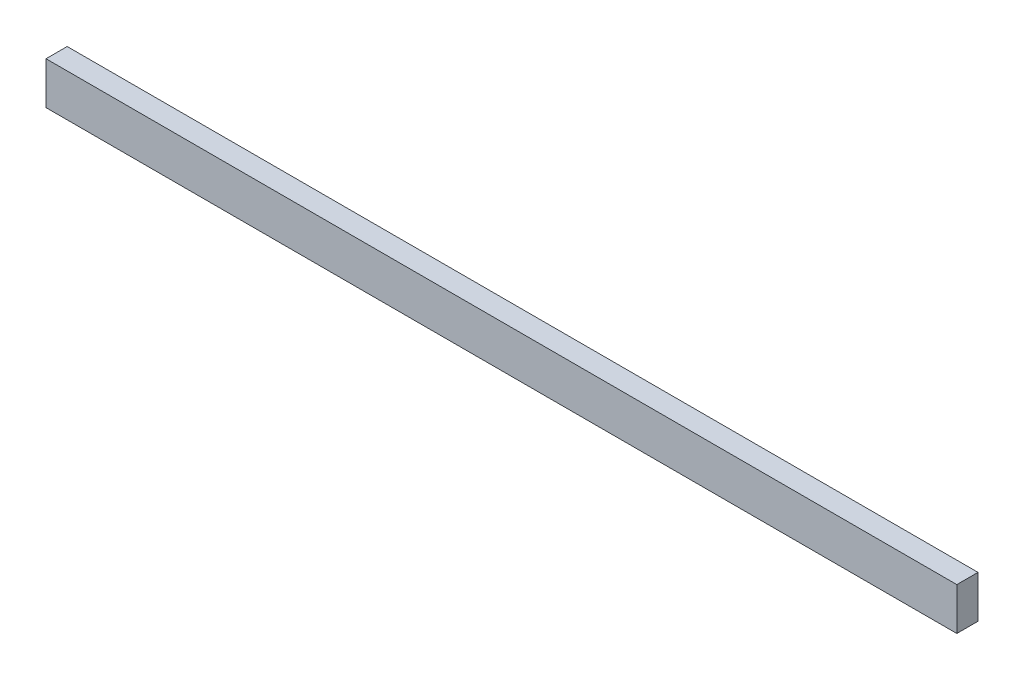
from build123d import *

# Parameters (mm, degrees)
SKETCH1_W           = 409.575
SKETCH1_H           = 19.05
BOSS_EXTRUDE1_DEPTH = 9.525


with BuildPart() as part:
    # Sketch1 → Boss-Extrude1 (new body)
    with BuildSketch(Plane.XY):
        with Locations((204.7875, 9.525)):
            Rectangle(SKETCH1_W, SKETCH1_H)
    extrude(amount=BOSS_EXTRUDE1_DEPTH)


solid = part.part
